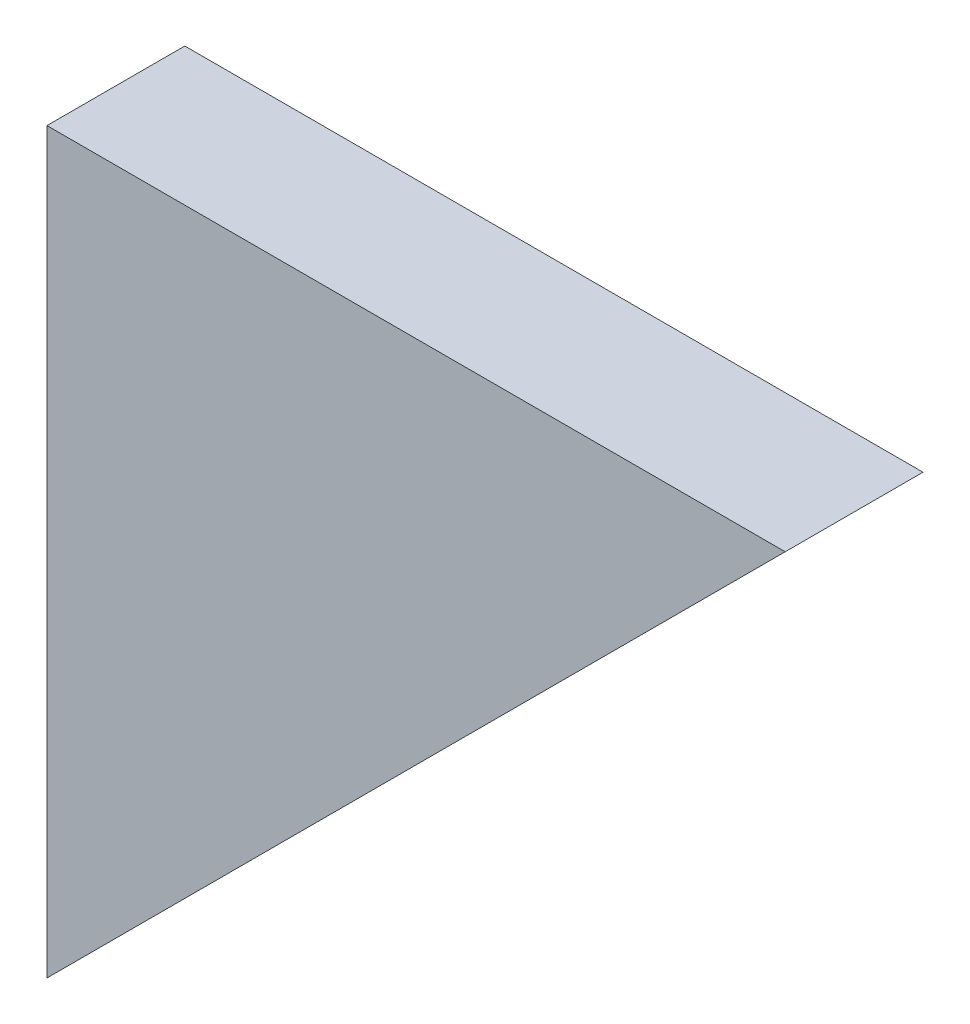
ISO-10303-21;
HEADER;
FILE_DESCRIPTION(('STEP AP214'),'2;1');
FILE_NAME('part.step','',(''),(''),'','','');
FILE_SCHEMA(('AUTOMOTIVE_DESIGN { 1 0 10303 214 1 1 1 1 }'));
ENDSEC;
DATA;
#1=APPLICATION_CONTEXT('core data for automotive mechanical design processes');
#2=APPLICATION_PROTOCOL_DEFINITION('international standard','automotive_design',2000,#1);
#3=PRODUCT_CONTEXT('',#1,'mechanical');
#4=PRODUCT('Part','Part','',(#3));
#5=PRODUCT_RELATED_PRODUCT_CATEGORY('part','',(#4));
#6=PRODUCT_DEFINITION_FORMATION('','',#4);
#7=PRODUCT_DEFINITION_CONTEXT('part definition',#1,'design');
#8=PRODUCT_DEFINITION('design','',#6,#7);
#9=PRODUCT_DEFINITION_SHAPE('','',#8);
#10=(LENGTH_UNIT() NAMED_UNIT(*) SI_UNIT(.MILLI.,.METRE.));
#11=(NAMED_UNIT(*) PLANE_ANGLE_UNIT() SI_UNIT($,.RADIAN.));
#12=(NAMED_UNIT(*) SI_UNIT($,.STERADIAN.) SOLID_ANGLE_UNIT());
#13=UNCERTAINTY_MEASURE_WITH_UNIT(LENGTH_MEASURE(1.E-05),#10,'distance_accuracy_value','');
#14=(GEOMETRIC_REPRESENTATION_CONTEXT(3) GLOBAL_UNCERTAINTY_ASSIGNED_CONTEXT((#13)) GLOBAL_UNIT_ASSIGNED_CONTEXT((#10,
#11,#12)) REPRESENTATION_CONTEXT('',''));
#15=CARTESIAN_POINT('',(0.,0.,0.));
#16=DIRECTION('',(0.,0.,1.));
#17=DIRECTION('',(1.,0.,0.));
#18=AXIS2_PLACEMENT_3D('',#15,#16,#17);
#19=CARTESIAN_POINT('',(-16.867718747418,14.6052631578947,5.6));
#20=DIRECTION('',(0.,-1.,0.));
#21=DIRECTION('',(1.,0.,0.));
#22=AXIS2_PLACEMENT_3D('',#19,#20,#21);
#23=PLANE('',#22);
#24=DIRECTION('',(-1.,0.,0.));
#25=VECTOR('',#24,1.);
#26=CARTESIAN_POINT('',(-16.867718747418,14.6052631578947,0.));
#27=LINE('',#26,#25);
#28=CARTESIAN_POINT('',(-16.867718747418,14.6052631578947,0.));
#29=VERTEX_POINT('',#28);
#30=CARTESIAN_POINT('',(-46.867718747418,14.6052631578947,0.));
#31=VERTEX_POINT('',#30);
#32=EDGE_CURVE('E85',#29,#31,#27,.T.);
#33=ORIENTED_EDGE('',*,*,#32,.T.);
#34=DIRECTION('',(0.,0.,-1.));
#35=VECTOR('',#34,1.);
#36=CARTESIAN_POINT('',(-46.867718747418,14.6052631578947,5.6));
#37=LINE('',#36,#35);
#38=CARTESIAN_POINT('',(-46.867718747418,14.6052631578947,5.6));
#39=VERTEX_POINT('',#38);
#40=EDGE_CURVE('E12',#39,#31,#37,.T.);
#41=ORIENTED_EDGE('',*,*,#40,.F.);
#42=DIRECTION('',(-1.,0.,0.));
#43=VECTOR('',#42,1.);
#44=CARTESIAN_POINT('',(-16.867718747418,14.6052631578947,5.6));
#45=LINE('',#44,#43);
#46=CARTESIAN_POINT('',(-16.867718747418,14.6052631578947,5.6));
#47=VERTEX_POINT('',#46);
#48=EDGE_CURVE('E77',#47,#39,#45,.T.);
#49=ORIENTED_EDGE('',*,*,#48,.F.);
#50=DIRECTION('',(0.,0.,-1.));
#51=VECTOR('',#50,1.);
#52=CARTESIAN_POINT('',(-16.867718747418,14.6052631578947,5.6));
#53=LINE('',#52,#51);
#54=EDGE_CURVE('E86',#47,#29,#53,.T.);
#55=ORIENTED_EDGE('',*,*,#54,.T.);
#56=EDGE_LOOP('',(#33,#41,#49,#55));
#57=FACE_BOUND('',#56,.T.);
#58=ADVANCED_FACE('F36',(#57),#23,.F.);
#59=CARTESIAN_POINT('',(-46.867718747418,14.6052631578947,5.6));
#60=DIRECTION('',(1.,0.,0.));
#61=DIRECTION('',(0.,0.,-1.));
#62=AXIS2_PLACEMENT_3D('',#59,#60,#61);
#63=PLANE('',#62);
#64=DIRECTION('',(0.,-1.,0.));
#65=VECTOR('',#64,1.);
#66=CARTESIAN_POINT('',(-46.867718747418,14.6052631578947,0.));
#67=LINE('',#66,#65);
#68=CARTESIAN_POINT('',(-46.867718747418,-15.3947368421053,0.));
#69=VERTEX_POINT('',#68);
#70=EDGE_CURVE('E64',#31,#69,#67,.T.);
#71=ORIENTED_EDGE('',*,*,#70,.T.);
#72=DIRECTION('',(0.,0.,-1.));
#73=VECTOR('',#72,1.);
#74=CARTESIAN_POINT('',(-46.867718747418,-15.3947368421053,5.6));
#75=LINE('',#74,#73);
#76=CARTESIAN_POINT('',(-46.867718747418,-15.3947368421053,5.6));
#77=VERTEX_POINT('',#76);
#78=EDGE_CURVE('E44',#77,#69,#75,.T.);
#79=ORIENTED_EDGE('',*,*,#78,.F.);
#80=DIRECTION('',(0.,-1.,0.));
#81=VECTOR('',#80,1.);
#82=CARTESIAN_POINT('',(-46.867718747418,14.6052631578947,5.6));
#83=LINE('',#82,#81);
#84=EDGE_CURVE('E72',#39,#77,#83,.T.);
#85=ORIENTED_EDGE('',*,*,#84,.F.);
#86=ORIENTED_EDGE('',*,*,#40,.T.);
#87=EDGE_LOOP('',(#71,#79,#85,#86));
#88=FACE_BOUND('',#87,.T.);
#89=ADVANCED_FACE('F73',(#88),#63,.F.);
#90=CARTESIAN_POINT('',(-46.867718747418,-15.3947368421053,5.6));
#91=DIRECTION('',(-0.707106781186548,0.707106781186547,0.));
#92=DIRECTION('',(-0.707106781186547,-0.707106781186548,0.));
#93=AXIS2_PLACEMENT_3D('',#90,#91,#92);
#94=PLANE('',#93);
#95=DIRECTION('',(0.707106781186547,0.707106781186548,0.));
#96=VECTOR('',#95,1.);
#97=CARTESIAN_POINT('',(-46.867718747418,-15.3947368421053,0.));
#98=LINE('',#97,#96);
#99=EDGE_CURVE('E69',#69,#29,#98,.T.);
#100=ORIENTED_EDGE('',*,*,#99,.T.);
#101=ORIENTED_EDGE('',*,*,#54,.F.);
#102=DIRECTION('',(0.707106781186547,0.707106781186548,0.));
#103=VECTOR('',#102,1.);
#104=CARTESIAN_POINT('',(-46.867718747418,-15.3947368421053,5.6));
#105=LINE('',#104,#103);
#106=EDGE_CURVE('E52',#77,#47,#105,.T.);
#107=ORIENTED_EDGE('',*,*,#106,.F.);
#108=ORIENTED_EDGE('',*,*,#78,.T.);
#109=EDGE_LOOP('',(#100,#101,#107,#108));
#110=FACE_BOUND('',#109,.T.);
#111=ADVANCED_FACE('F93',(#110),#94,.F.);
#112=CARTESIAN_POINT('',(0.,0.,5.6));
#113=DIRECTION('',(0.,0.,1.));
#114=DIRECTION('',(1.,0.,0.));
#115=AXIS2_PLACEMENT_3D('',#112,#113,#114);
#116=PLANE('',#115);
#117=ORIENTED_EDGE('',*,*,#48,.T.);
#118=ORIENTED_EDGE('',*,*,#84,.T.);
#119=ORIENTED_EDGE('',*,*,#106,.T.);
#120=EDGE_LOOP('',(#117,#118,#119));
#121=FACE_BOUND('',#120,.T.);
#122=ADVANCED_FACE('F80',(#121),#116,.T.);
#123=CARTESIAN_POINT('',(0.,0.,0.));
#124=DIRECTION('',(0.,0.,1.));
#125=DIRECTION('',(1.,0.,0.));
#126=AXIS2_PLACEMENT_3D('',#123,#124,#125);
#127=PLANE('',#126);
#128=ORIENTED_EDGE('',*,*,#32,.F.);
#129=ORIENTED_EDGE('',*,*,#99,.F.);
#130=ORIENTED_EDGE('',*,*,#70,.F.);
#131=EDGE_LOOP('',(#128,#129,#130));
#132=FACE_BOUND('',#131,.T.);
#133=ADVANCED_FACE('F94',(#132),#127,.F.);
#134=CLOSED_SHELL('',(#58,#89,#111,#122,#133));
#135=MANIFOLD_SOLID_BREP('B2',#134);
#136=ADVANCED_BREP_SHAPE_REPRESENTATION('',(#18,#135),#14);
#137=SHAPE_DEFINITION_REPRESENTATION(#9,#136);
ENDSEC;
END-ISO-10303-21;
